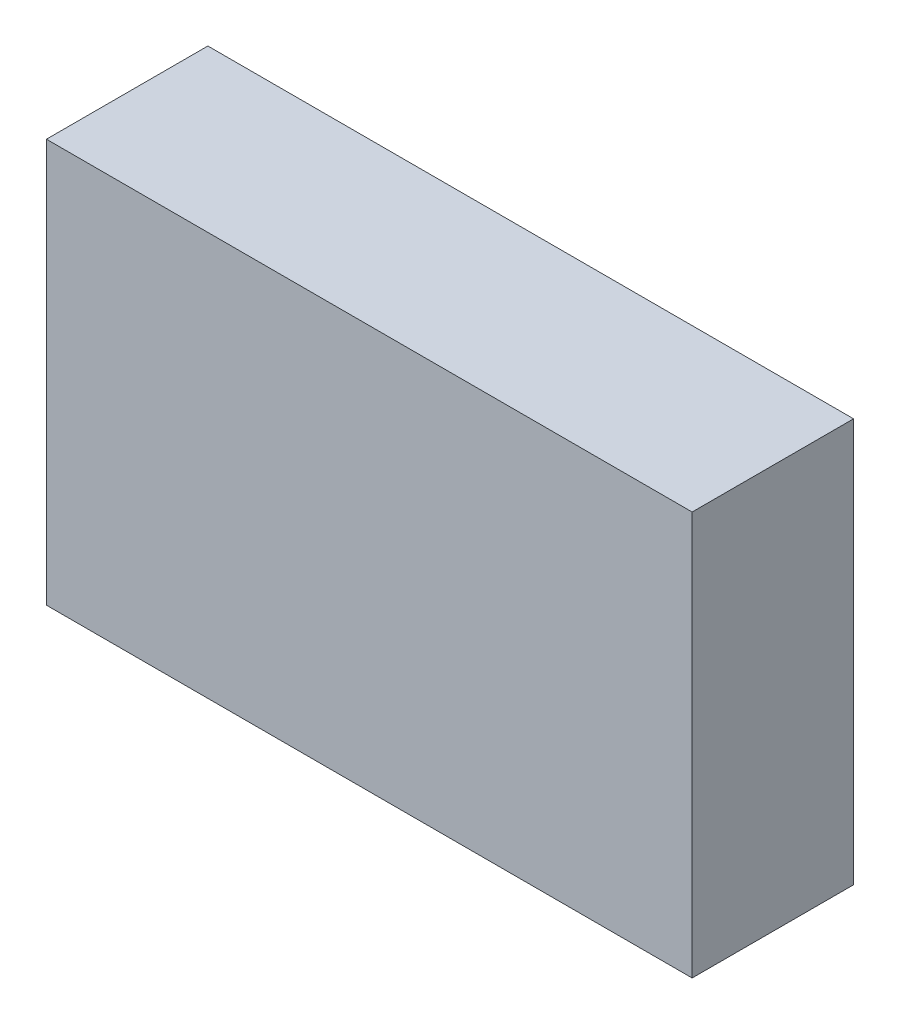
from build123d import *

# Parameters (mm, degrees)
SKETCH1_W      = 101.6
SKETCH1_H      = 63.5
EXTRUDE1_DEPTH = 25.4


with BuildPart() as part:
    # Sketch1 → Extrude1 (new body)
    with BuildSketch(Plane.XY):
        with Locations((50.8, 31.75)):
            Rectangle(SKETCH1_W, SKETCH1_H)
    extrude(amount=EXTRUDE1_DEPTH)


solid = part.part
